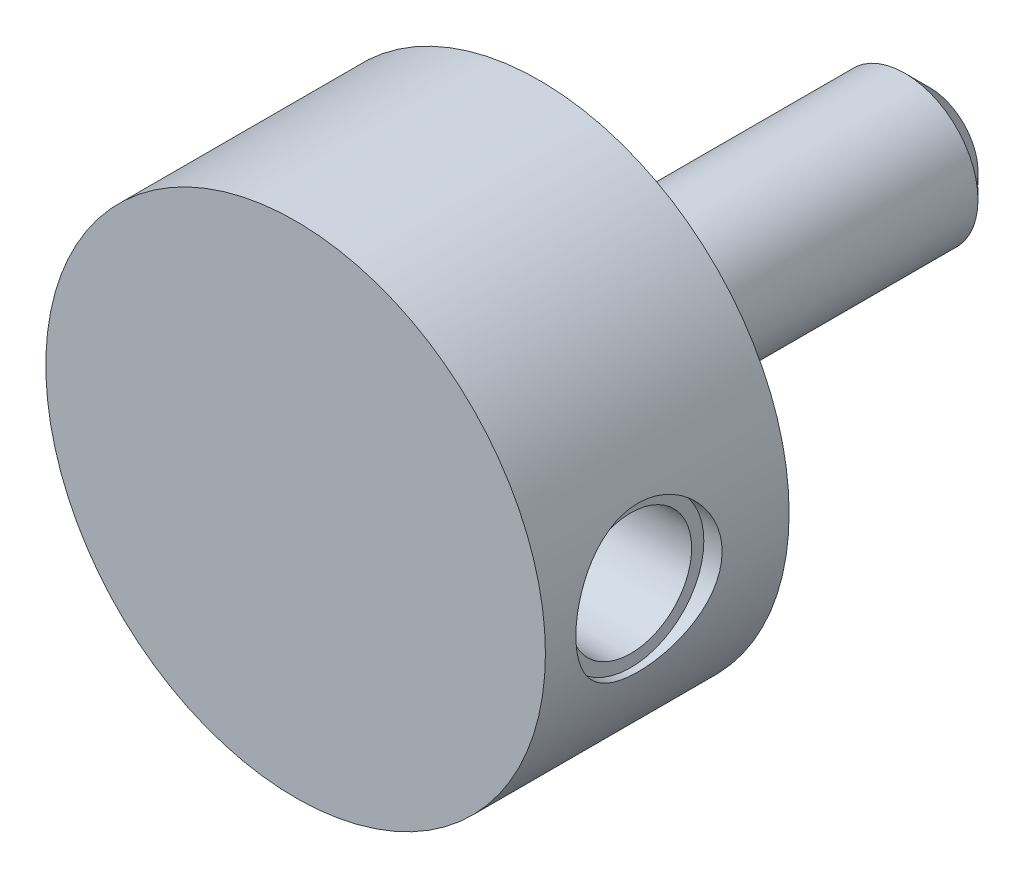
ISO-10303-21;
HEADER;
FILE_DESCRIPTION(('STEP AP214'),'2;1');
FILE_NAME('part.step','',(''),(''),'','','');
FILE_SCHEMA(('AUTOMOTIVE_DESIGN { 1 0 10303 214 1 1 1 1 }'));
ENDSEC;
DATA;
#1=APPLICATION_CONTEXT('core data for automotive mechanical design processes');
#2=APPLICATION_PROTOCOL_DEFINITION('international standard','automotive_design',2000,#1);
#3=PRODUCT_CONTEXT('',#1,'mechanical');
#4=PRODUCT('Part','Part','',(#3));
#5=PRODUCT_RELATED_PRODUCT_CATEGORY('part','',(#4));
#6=PRODUCT_DEFINITION_FORMATION('','',#4);
#7=PRODUCT_DEFINITION_CONTEXT('part definition',#1,'design');
#8=PRODUCT_DEFINITION('design','',#6,#7);
#9=PRODUCT_DEFINITION_SHAPE('','',#8);
#10=(LENGTH_UNIT() NAMED_UNIT(*) SI_UNIT(.MILLI.,.METRE.));
#11=(NAMED_UNIT(*) PLANE_ANGLE_UNIT() SI_UNIT($,.RADIAN.));
#12=(NAMED_UNIT(*) SI_UNIT($,.STERADIAN.) SOLID_ANGLE_UNIT());
#13=UNCERTAINTY_MEASURE_WITH_UNIT(LENGTH_MEASURE(1.E-05),#10,'distance_accuracy_value','');
#14=(GEOMETRIC_REPRESENTATION_CONTEXT(3) GLOBAL_UNCERTAINTY_ASSIGNED_CONTEXT((#13)) GLOBAL_UNIT_ASSIGNED_CONTEXT((#10,
#11,#12)) REPRESENTATION_CONTEXT('',''));
#15=CARTESIAN_POINT('',(0.,0.,0.));
#16=DIRECTION('',(0.,0.,1.));
#17=DIRECTION('',(1.,0.,0.));
#18=AXIS2_PLACEMENT_3D('',#15,#16,#17);
#19=CARTESIAN_POINT('',(0.,0.,0.));
#20=DIRECTION('',(0.,0.,1.));
#21=DIRECTION('',(1.,0.,0.));
#22=AXIS2_PLACEMENT_3D('',#19,#20,#21);
#23=PLANE('',#22);
#24=CARTESIAN_POINT('',(0.,0.,0.));
#25=DIRECTION('',(0.,0.,1.));
#26=DIRECTION('',(1.,0.,0.));
#27=AXIS2_PLACEMENT_3D('',#24,#25,#26);
#28=CIRCLE('',#27,9.5);
#29=CARTESIAN_POINT('',(9.5,0.,0.));
#30=VERTEX_POINT('',#29);
#31=EDGE_CURVE('E27',#30,#30,#28,.T.);
#32=ORIENTED_EDGE('',*,*,#31,.F.);
#33=EDGE_LOOP('',(#32));
#34=FACE_BOUND('',#33,.T.);
#35=CARTESIAN_POINT('',(0.,0.,0.));
#36=DIRECTION('',(0.,0.,1.));
#37=DIRECTION('',(1.,0.,0.));
#38=AXIS2_PLACEMENT_3D('',#35,#36,#37);
#39=CIRCLE('',#38,6.);
#40=CARTESIAN_POINT('',(6.,0.,0.));
#41=VERTEX_POINT('',#40);
#42=EDGE_CURVE('E23',#41,#41,#39,.F.);
#43=ORIENTED_EDGE('',*,*,#42,.F.);
#44=EDGE_LOOP('',(#43));
#45=FACE_BOUND('',#44,.T.);
#46=ADVANCED_FACE('F12',(#34,#45),#23,.F.);
#47=CARTESIAN_POINT('',(0.,0.,40.));
#48=DIRECTION('',(0.,0.,1.));
#49=DIRECTION('',(1.,0.,0.));
#50=AXIS2_PLACEMENT_3D('',#47,#48,#49);
#51=CYLINDRICAL_SURFACE('',#50,9.5);
#52=CARTESIAN_POINT('',(0.,0.,2.));
#53=DIRECTION('',(0.,0.,1.));
#54=DIRECTION('',(1.,0.,0.));
#55=AXIS2_PLACEMENT_3D('',#52,#53,#54);
#56=CIRCLE('',#55,9.5);
#57=CARTESIAN_POINT('',(9.5,0.,2.));
#58=VERTEX_POINT('',#57);
#59=EDGE_CURVE('E38',#58,#58,#56,.T.);
#60=ORIENTED_EDGE('',*,*,#59,.F.);
#61=EDGE_LOOP('',(#60));
#62=FACE_BOUND('',#61,.T.);
#63=ORIENTED_EDGE('',*,*,#31,.T.);
#64=EDGE_LOOP('',(#63));
#65=FACE_BOUND('',#64,.T.);
#66=ADVANCED_FACE('F65',(#62,#65),#51,.T.);
#67=CARTESIAN_POINT('',(20.5,0.,22.));
#68=DIRECTION('',(0.,0.,-1.));
#69=DIRECTION('',(-1.,0.,0.));
#70=AXIS2_PLACEMENT_3D('',#67,#68,#69);
#71=PLANE('',#70);
#72=CARTESIAN_POINT('',(0.,0.,22.));
#73=DIRECTION('',(0.,0.,1.));
#74=DIRECTION('',(1.,0.,0.));
#75=AXIS2_PLACEMENT_3D('',#72,#73,#74);
#76=CIRCLE('',#75,20.5);
#77=CARTESIAN_POINT('',(20.5,0.,22.));
#78=VERTEX_POINT('',#77);
#79=EDGE_CURVE('E82',#78,#78,#76,.T.);
#80=ORIENTED_EDGE('',*,*,#79,.T.);
#81=EDGE_LOOP('',(#80));
#82=FACE_BOUND('',#81,.T.);
#83=ADVANCED_FACE('F60',(#82),#71,.F.);
#84=CARTESIAN_POINT('',(0.,0.,40.));
#85=DIRECTION('',(0.,0.,1.));
#86=DIRECTION('',(1.,0.,0.));
#87=AXIS2_PLACEMENT_3D('',#84,#85,#86);
#88=CYLINDRICAL_SURFACE('',#87,20.5);
#89=CARTESIAN_POINT('',(20.5,0.,7.5));
#90=CARTESIAN_POINT('',(20.4999997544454,-0.164768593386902,7.50000038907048));
#91=CARTESIAN_POINT('',(20.4980087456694,-0.329544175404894,7.50679278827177));
#92=CARTESIAN_POINT('',(20.4900990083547,-0.65788822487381,7.5339021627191));
#93=CARTESIAN_POINT('',(20.4841800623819,-0.821456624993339,7.55421988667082));
#94=CARTESIAN_POINT('',(20.4685766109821,-1.1462122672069,7.60820100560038));
#95=CARTESIAN_POINT('',(20.4588916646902,-1.30739922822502,7.64186596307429));
#96=CARTESIAN_POINT('',(20.4360164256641,-1.62628314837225,7.72226244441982));
#97=CARTESIAN_POINT('',(20.4228249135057,-1.7839788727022,7.76899851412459));
#98=CARTESIAN_POINT('',(20.3933182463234,-2.09448185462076,7.87505403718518));
#99=CARTESIAN_POINT('',(20.3770082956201,-2.24729676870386,7.93435254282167));
#100=CARTESIAN_POINT('',(20.3416823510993,-2.54730770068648,8.06511256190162));
#101=CARTESIAN_POINT('',(20.3226662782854,-2.69450355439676,8.13657443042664));
#102=CARTESIAN_POINT('',(20.2824208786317,-2.98237032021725,8.2911456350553));
#103=CARTESIAN_POINT('',(20.2611910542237,-3.123039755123,8.37425759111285));
#104=CARTESIAN_POINT('',(20.2170775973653,-3.39691169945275,8.55150630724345));
#105=CARTESIAN_POINT('',(20.1941944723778,-3.53011647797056,8.6456396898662));
#106=CARTESIAN_POINT('',(20.146767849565,-3.79154794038,8.84682399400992));
#107=CARTESIAN_POINT('',(20.1221971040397,-3.91956600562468,8.95413966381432));
#108=CARTESIAN_POINT('',(20.0725990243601,-4.1661228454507,9.17897611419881));
#109=CARTESIAN_POINT('',(20.0475718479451,-4.2846648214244,9.29649342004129));
#110=CARTESIAN_POINT('',(19.9977175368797,-4.5116297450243,9.54108035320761));
#111=CARTESIAN_POINT('',(19.9728905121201,-4.62004743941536,9.66815487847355));
#112=CARTESIAN_POINT('',(19.9241410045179,-4.82595045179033,9.93095842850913));
#113=CARTESIAN_POINT('',(19.9002181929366,-4.92343976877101,10.0666842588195));
#114=CARTESIAN_POINT('',(19.8534354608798,-5.10885934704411,10.3490171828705));
#115=CARTESIAN_POINT('',(19.8306098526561,-5.19653638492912,10.4957964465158));
#116=CARTESIAN_POINT('',(19.7872868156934,-5.35913808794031,10.7965125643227));
#117=CARTESIAN_POINT('',(19.766788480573,-5.43406772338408,10.9504465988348));
#118=CARTESIAN_POINT('',(19.7287391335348,-5.57062666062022,11.2645036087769));
#119=CARTESIAN_POINT('',(19.7111887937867,-5.63225293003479,11.4246279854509));
#120=CARTESIAN_POINT('',(19.6796082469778,-5.74162541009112,11.7498143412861));
#121=CARTESIAN_POINT('',(19.6655765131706,-5.78937764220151,11.9148741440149));
#122=CARTESIAN_POINT('',(19.6418018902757,-5.86952471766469,12.2443484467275));
#123=CARTESIAN_POINT('',(19.6319555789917,-5.90229162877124,12.4086649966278));
#124=CARTESIAN_POINT('',(19.6163432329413,-5.95397424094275,12.7395899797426));
#125=CARTESIAN_POINT('',(19.6105755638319,-5.97289549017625,12.9061974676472));
#126=CARTESIAN_POINT('',(19.603301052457,-5.99672775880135,13.2405034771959));
#127=CARTESIAN_POINT('',(19.6017941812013,-6.00163887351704,13.4082019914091));
#128=CARTESIAN_POINT('',(19.6030905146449,-5.99740342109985,13.7434027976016));
#129=CARTESIAN_POINT('',(19.6058936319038,-5.98825713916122,13.9109050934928));
#130=CARTESIAN_POINT('',(19.6155486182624,-5.95655212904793,14.238688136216));
#131=CARTESIAN_POINT('',(19.6222578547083,-5.9344657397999,14.3990190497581));
#132=CARTESIAN_POINT('',(19.6394095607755,-5.87745500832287,14.7172343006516));
#133=CARTESIAN_POINT('',(19.649853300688,-5.84252629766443,14.8751177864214));
#134=CARTESIAN_POINT('',(19.6741615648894,-5.7601395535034,15.187257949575));
#135=CARTESIAN_POINT('',(19.688025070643,-5.71268525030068,15.3415156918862));
#136=CARTESIAN_POINT('',(19.7187796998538,-5.60560692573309,15.6454959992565));
#137=CARTESIAN_POINT('',(19.7356719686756,-5.5459782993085,15.7952168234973));
#138=CARTESIAN_POINT('',(19.7722410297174,-5.41416819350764,16.0910079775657));
#139=CARTESIAN_POINT('',(19.7919506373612,-5.34183608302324,16.2370072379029));
#140=CARTESIAN_POINT('',(19.8334359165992,-5.18568691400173,16.5224423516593));
#141=CARTESIAN_POINT('',(19.8552123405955,-5.10186566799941,16.6618757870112));
#142=CARTESIAN_POINT('',(19.9227548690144,-4.8340177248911,17.0689782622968));
#143=CARTESIAN_POINT('',(19.9707648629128,-4.63350124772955,17.3256854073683));
#144=CARTESIAN_POINT('',(20.0696162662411,-4.18511260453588,17.8126329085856));
#145=CARTESIAN_POINT('',(20.1204944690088,-3.93567819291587,18.0414205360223));
#146=CARTESIAN_POINT('',(20.2176813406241,-3.40132203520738,18.4542852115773));
#147=CARTESIAN_POINT('',(20.2639897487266,-3.11639826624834,18.63835970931));
#148=CARTESIAN_POINT('',(20.3472018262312,-2.51664006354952,18.9573414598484));
#149=CARTESIAN_POINT('',(20.3840462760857,-2.2016334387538,19.0919412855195));
#150=CARTESIAN_POINT('',(20.4437541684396,-1.55212614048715,19.3058343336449));
#151=CARTESIAN_POINT('',(20.4666213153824,-1.21763065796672,19.3851422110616));
#152=CARTESIAN_POINT('',(20.4952175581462,-0.550953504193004,19.4838192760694));
#153=CARTESIAN_POINT('',(20.5015074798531,-0.219085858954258,19.5051506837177));
#154=CARTESIAN_POINT('',(20.4978783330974,0.44350281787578,19.4927506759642));
#155=CARTESIAN_POINT('',(20.4879613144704,0.774223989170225,19.4590262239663));
#156=CARTESIAN_POINT('',(20.4533992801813,1.41781519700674,19.3390673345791));
#157=CARTESIAN_POINT('',(20.4290727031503,1.73091547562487,19.253967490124));
#158=CARTESIAN_POINT('',(20.3684901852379,2.33834273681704,19.0350155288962));
#159=CARTESIAN_POINT('',(20.3322328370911,2.63266749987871,18.901157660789));
#160=CARTESIAN_POINT('',(20.2505580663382,3.201467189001,18.585163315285));
#161=CARTESIAN_POINT('',(20.2049537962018,3.47535043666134,18.4020133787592));
#162=CARTESIAN_POINT('',(20.1098009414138,3.98926947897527,17.9937010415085));
#163=CARTESIAN_POINT('',(20.0602514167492,4.22929716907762,17.7685286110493));
#164=CARTESIAN_POINT('',(19.9860369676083,4.56311282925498,17.3996018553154));
#165=CARTESIAN_POINT('',(19.9608943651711,4.67160496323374,17.2689475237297));
#166=CARTESIAN_POINT('',(19.9116554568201,4.87720494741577,16.9988051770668));
#167=CARTESIAN_POINT('',(19.8875587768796,4.97431688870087,16.8593203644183));
#168=CARTESIAN_POINT('',(19.8411019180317,5.15650338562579,16.5723575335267));
#169=CARTESIAN_POINT('',(19.8187424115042,5.24157329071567,16.4248764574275));
#170=CARTESIAN_POINT('',(19.7764458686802,5.39896546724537,16.1230001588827));
#171=CARTESIAN_POINT('',(19.7565078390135,5.47129297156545,15.9686078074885));
#172=CARTESIAN_POINT('',(19.7197444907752,5.60234699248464,15.6546484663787));
#173=CARTESIAN_POINT('',(19.7029051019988,5.6611353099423,15.49510893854));
#174=CARTESIAN_POINT('',(19.6727610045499,5.76501533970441,15.1713718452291));
#175=CARTESIAN_POINT('',(19.6594548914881,5.81011249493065,15.0071761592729));
#176=CARTESIAN_POINT('',(19.6367999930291,5.88622676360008,14.675294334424));
#177=CARTESIAN_POINT('',(19.6274509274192,5.91724487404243,14.5076084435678));
#178=CARTESIAN_POINT('',(19.6130187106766,5.96490739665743,14.1700260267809));
#179=CARTESIAN_POINT('',(19.6079354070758,5.98155232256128,14.0001295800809));
#180=CARTESIAN_POINT('',(19.6023186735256,5.9999323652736,13.6662567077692));
#181=CARTESIAN_POINT('',(19.6016119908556,6.00223524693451,13.5023141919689));
#182=CARTESIAN_POINT('',(19.6043094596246,5.99341910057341,13.1747666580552));
#183=CARTESIAN_POINT('',(19.6077150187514,5.98229547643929,13.0111617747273));
#184=CARTESIAN_POINT('',(19.6185313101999,5.94672790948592,12.6856110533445));
#185=CARTESIAN_POINT('',(19.6259403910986,5.92228945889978,12.5236645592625));
#186=CARTESIAN_POINT('',(19.6445384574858,5.86030325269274,12.2024601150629));
#187=CARTESIAN_POINT('',(19.6557288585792,5.82275058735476,12.0432031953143));
#188=CARTESIAN_POINT('',(19.6814005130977,5.73537439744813,11.7303823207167));
#189=CARTESIAN_POINT('',(19.6958418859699,5.68569901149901,11.5767736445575));
#190=CARTESIAN_POINT('',(19.7276768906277,5.57423736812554,11.2742707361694));
#191=CARTESIAN_POINT('',(19.7450715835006,5.51244675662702,11.125378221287));
#192=CARTESIAN_POINT('',(19.782319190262,5.37724463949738,10.8333301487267));
#193=CARTESIAN_POINT('',(19.802171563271,5.30383568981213,10.6901733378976));
#194=CARTESIAN_POINT('',(19.8438063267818,5.14587421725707,10.4103722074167));
#195=CARTESIAN_POINT('',(19.8655894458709,5.061317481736,10.2737303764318));
#196=CARTESIAN_POINT('',(19.9112797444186,4.87853600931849,10.0032239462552));
#197=CARTESIAN_POINT('',(19.9352342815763,4.77994030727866,9.86961789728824));
#198=CARTESIAN_POINT('',(19.9839347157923,4.57206196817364,9.61107007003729));
#199=CARTESIAN_POINT('',(20.0086809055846,4.46277534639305,9.48613155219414));
#200=CARTESIAN_POINT('',(20.0582834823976,4.23425660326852,9.24575891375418));
#201=CARTESIAN_POINT('',(20.0831398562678,4.11502564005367,9.13032368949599));
#202=CARTESIAN_POINT('',(20.1323098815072,3.86730499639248,8.90963180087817));
#203=CARTESIAN_POINT('',(20.1566233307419,3.7388119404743,8.80437888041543));
#204=CARTESIAN_POINT('',(20.2046974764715,3.46977987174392,8.6020699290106));
#205=CARTESIAN_POINT('',(20.2284250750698,3.32900807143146,8.50531528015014));
#206=CARTESIAN_POINT('',(20.2739466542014,3.03949915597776,8.32403500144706));
#207=CARTESIAN_POINT('',(20.2957406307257,2.8907620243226,8.23950939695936));
#208=CARTESIAN_POINT('',(20.3367679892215,2.58639447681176,8.0833769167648));
#209=CARTESIAN_POINT('',(20.356002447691,2.43076699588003,8.01176460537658));
#210=CARTESIAN_POINT('',(20.3913677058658,2.11366097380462,7.88201306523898));
#211=CARTESIAN_POINT('',(20.4074988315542,1.95218304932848,7.82387242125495));
#212=CARTESIAN_POINT('',(20.4344672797,1.64423058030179,7.72771145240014));
#213=CARTESIAN_POINT('',(20.4457076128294,1.49828162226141,7.68811373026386));
#214=CARTESIAN_POINT('',(20.4651675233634,1.2036242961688,7.62002138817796));
#215=CARTESIAN_POINT('',(20.4733873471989,1.0549161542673,7.59152586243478));
#216=CARTESIAN_POINT('',(20.4866168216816,0.755624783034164,7.54584620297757));
#217=CARTESIAN_POINT('',(20.491626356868,0.605041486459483,7.52866247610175));
#218=CARTESIAN_POINT('',(20.49831762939,0.302973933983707,7.50574067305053));
#219=CARTESIAN_POINT('',(20.5000002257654,0.151489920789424,7.49999964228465));
#220=CARTESIAN_POINT('',(20.5,0.,7.5));
#221=B_SPLINE_CURVE_WITH_KNOTS('',3,(#89,#90,#91,#92,#93,#94,#95,#96,#97,#98,#99,#100,#101,#102,
#103,#104,#105,#106,#107,#108,#109,#110,#111,#112,#113,#114,#115,#116,#117,#118,#119,#120,#121,
#122,#123,#124,#125,#126,#127,#128,#129,#130,#131,#132,#133,#134,#135,#136,#137,#138,#139,#140,
#141,#142,#143,#144,#145,#146,#147,#148,#149,#150,#151,#152,#153,#154,#155,#156,#157,#158,#159,
#160,#161,#162,#163,#164,#165,#166,#167,#168,#169,#170,#171,#172,#173,#174,#175,#176,#177,#178,
#179,#180,#181,#182,#183,#184,#185,#186,#187,#188,#189,#190,#191,#192,#193,#194,#195,#196,#197,
#198,#199,#200,#201,#202,#203,#204,#205,#206,#207,#208,#209,#210,#211,#212,#213,#214,#215,#216,
#217,#218,#219,#220),.UNSPECIFIED.,.T.,.F.,(4,2,2,2,2,2,2,2,2,2,2,2,2,2,2,2,2,2,2,2,2,2,2,2,2,2,
2,2,2,2,2,2,2,2,2,2,2,2,2,2,2,2,2,2,2,2,2,2,2,2,2,2,2,2,2,2,2,2,2,2,2,2,2,2,2,4),(0.,
0.494166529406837,0.988360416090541,1.48261217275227,1.97703603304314,2.47064184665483,
2.96426207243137,3.45799348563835,3.95157399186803,4.45753270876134,4.96331976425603,
5.46936781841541,5.97523008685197,6.49206535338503,7.00869863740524,7.52544955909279,
8.04197586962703,8.54486934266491,9.04756118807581,9.55024961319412,10.0529278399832,
10.5383093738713,11.0238561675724,11.5092585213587,11.9948448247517,12.4866344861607,
12.9786038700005,13.9617709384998,14.9839152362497,16.006117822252,17.0345689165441,
18.062747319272,19.0556662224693,20.0484595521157,21.0200911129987,21.9918373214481,
22.9853318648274,23.97906383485,24.4935931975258,25.0079370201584,25.5224789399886,
26.0368090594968,26.5487427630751,27.0604726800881,27.5721663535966,28.0838417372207,
28.5751252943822,29.066577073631,29.5578262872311,30.0492596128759,30.5349645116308,
31.0208442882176,31.5066173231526,31.9925744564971,32.4953010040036,32.9982156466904,
33.5010718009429,34.0041121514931,34.5208552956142,35.0375995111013,35.5541256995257,
36.0705976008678,36.525077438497,36.9795201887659,37.4339792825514,37.8883210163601),.UNSPECIFIED.);
#222=CARTESIAN_POINT('',(20.5,0.,7.5));
#223=VERTEX_POINT('',#222);
#224=EDGE_CURVE('E30',#223,#223,#221,.T.);
#225=ORIENTED_EDGE('',*,*,#224,.T.);
#226=EDGE_LOOP('',(#225));
#227=FACE_BOUND('',#226,.T.);
#228=ORIENTED_EDGE('',*,*,#79,.F.);
#229=EDGE_LOOP('',(#228));
#230=FACE_BOUND('',#229,.T.);
#231=CARTESIAN_POINT('',(0.,0.,2.));
#232=DIRECTION('',(0.,0.,1.));
#233=DIRECTION('',(1.,0.,0.));
#234=AXIS2_PLACEMENT_3D('',#231,#232,#233);
#235=CIRCLE('',#234,20.5);
#236=CARTESIAN_POINT('',(20.5,0.,2.));
#237=VERTEX_POINT('',#236);
#238=EDGE_CURVE('E84',#237,#237,#235,.T.);
#239=ORIENTED_EDGE('',*,*,#238,.T.);
#240=EDGE_LOOP('',(#239));
#241=FACE_BOUND('',#240,.T.);
#242=ADVANCED_FACE('F41',(#227,#230,#241),#88,.T.);
#243=CARTESIAN_POINT('',(9.5,0.,2.));
#244=DIRECTION('',(0.,0.,1.));
#245=DIRECTION('',(1.,0.,0.));
#246=AXIS2_PLACEMENT_3D('',#243,#244,#245);
#247=PLANE('',#246);
#248=ORIENTED_EDGE('',*,*,#238,.F.);
#249=EDGE_LOOP('',(#248));
#250=FACE_BOUND('',#249,.T.);
#251=ORIENTED_EDGE('',*,*,#59,.T.);
#252=EDGE_LOOP('',(#251));
#253=FACE_BOUND('',#252,.T.);
#254=ADVANCED_FACE('F49',(#250,#253),#247,.F.);
#255=CARTESIAN_POINT('',(19.,0.,13.5));
#256=DIRECTION('',(1.,0.,0.));
#257=DIRECTION('',(0.,0.,-1.));
#258=AXIS2_PLACEMENT_3D('',#255,#256,#257);
#259=CYLINDRICAL_SURFACE('',#258,6.);
#260=CARTESIAN_POINT('',(19.,0.,13.5));
#261=DIRECTION('',(1.,0.,0.));
#262=DIRECTION('',(0.,0.,-1.));
#263=AXIS2_PLACEMENT_3D('',#260,#261,#262);
#264=CIRCLE('',#263,6.);
#265=CARTESIAN_POINT('',(19.,0.,7.5));
#266=VERTEX_POINT('',#265);
#267=EDGE_CURVE('E39',#266,#266,#264,.T.);
#268=ORIENTED_EDGE('',*,*,#267,.F.);
#269=EDGE_LOOP('',(#268));
#270=FACE_BOUND('',#269,.T.);
#271=ORIENTED_EDGE('',*,*,#224,.F.);
#272=EDGE_LOOP('',(#271));
#273=FACE_BOUND('',#272,.T.);
#274=ADVANCED_FACE('F47',(#270,#273),#259,.F.);
#275=CARTESIAN_POINT('',(19.,0.,13.5));
#276=DIRECTION('',(1.,0.,0.));
#277=DIRECTION('',(0.,0.,-1.));
#278=AXIS2_PLACEMENT_3D('',#275,#276,#277);
#279=PLANE('',#278);
#280=CARTESIAN_POINT('',(19.,0.,13.5));
#281=DIRECTION('',(1.,0.,0.));
#282=DIRECTION('',(0.,0.,-1.));
#283=AXIS2_PLACEMENT_3D('',#280,#281,#282);
#284=CIRCLE('',#283,5.);
#285=CARTESIAN_POINT('',(19.,0.,8.5));
#286=VERTEX_POINT('',#285);
#287=EDGE_CURVE('E96',#286,#286,#284,.T.);
#288=ORIENTED_EDGE('',*,*,#287,.F.);
#289=EDGE_LOOP('',(#288));
#290=FACE_BOUND('',#289,.T.);
#291=ORIENTED_EDGE('',*,*,#267,.T.);
#292=EDGE_LOOP('',(#291));
#293=FACE_BOUND('',#292,.T.);
#294=ADVANCED_FACE('F58',(#290,#293),#279,.T.);
#295=CARTESIAN_POINT('',(10.,0.,13.5));
#296=DIRECTION('',(1.,0.,0.));
#297=DIRECTION('',(0.,0.,-1.));
#298=AXIS2_PLACEMENT_3D('',#295,#296,#297);
#299=CYLINDRICAL_SURFACE('',#298,5.);
#300=CARTESIAN_POINT('',(10.,0.,13.5));
#301=DIRECTION('',(1.,0.,0.));
#302=DIRECTION('',(0.,0.,-1.));
#303=AXIS2_PLACEMENT_3D('',#300,#301,#302);
#304=CIRCLE('',#303,5.);
#305=CARTESIAN_POINT('',(10.,0.,8.5));
#306=VERTEX_POINT('',#305);
#307=EDGE_CURVE('E93',#306,#306,#304,.T.);
#308=ORIENTED_EDGE('',*,*,#307,.F.);
#309=EDGE_LOOP('',(#308));
#310=FACE_BOUND('',#309,.T.);
#311=ORIENTED_EDGE('',*,*,#287,.T.);
#312=EDGE_LOOP('',(#311));
#313=FACE_BOUND('',#312,.T.);
#314=ADVANCED_FACE('F100',(#310,#313),#299,.F.);
#315=CARTESIAN_POINT('',(10.,0.,13.5));
#316=DIRECTION('',(1.,0.,0.));
#317=DIRECTION('',(0.,0.,-1.));
#318=AXIS2_PLACEMENT_3D('',#315,#316,#317);
#319=PLANE('',#318);
#320=ORIENTED_EDGE('',*,*,#307,.T.);
#321=EDGE_LOOP('',(#320));
#322=FACE_BOUND('',#321,.T.);
#323=ADVANCED_FACE('F112',(#322),#319,.T.);
#324=CARTESIAN_POINT('',(0.,0.,-30.));
#325=DIRECTION('',(0.,0.,1.));
#326=DIRECTION('',(1.,0.,0.));
#327=AXIS2_PLACEMENT_3D('',#324,#325,#326);
#328=CYLINDRICAL_SURFACE('',#327,6.);
#329=CARTESIAN_POINT('',(0.,0.,-28.));
#330=DIRECTION('',(0.,0.,-1.));
#331=DIRECTION('',(-1.,0.,0.));
#332=AXIS2_PLACEMENT_3D('',#329,#330,#331);
#333=CIRCLE('',#332,6.);
#334=CARTESIAN_POINT('',(-6.,0.,-28.));
#335=VERTEX_POINT('',#334);
#336=EDGE_CURVE('E8',#335,#335,#333,.F.);
#337=ORIENTED_EDGE('',*,*,#336,.T.);
#338=EDGE_LOOP('',(#337));
#339=FACE_BOUND('',#338,.T.);
#340=ORIENTED_EDGE('',*,*,#42,.T.);
#341=EDGE_LOOP('',(#340));
#342=FACE_BOUND('',#341,.T.);
#343=ADVANCED_FACE('F118',(#339,#342),#328,.T.);
#344=CARTESIAN_POINT('',(0.,0.,-30.));
#345=DIRECTION('',(0.,0.,-1.));
#346=DIRECTION('',(-1.,0.,0.));
#347=AXIS2_PLACEMENT_3D('',#344,#345,#346);
#348=PLANE('',#347);
#349=CARTESIAN_POINT('',(0.,0.,-30.));
#350=DIRECTION('',(0.,0.,-1.));
#351=DIRECTION('',(-1.,0.,0.));
#352=AXIS2_PLACEMENT_3D('',#349,#350,#351);
#353=CIRCLE('',#352,4.);
#354=CARTESIAN_POINT('',(-4.,0.,-30.));
#355=VERTEX_POINT('',#354);
#356=EDGE_CURVE('E19',#355,#355,#353,.T.);
#357=ORIENTED_EDGE('',*,*,#356,.T.);
#358=EDGE_LOOP('',(#357));
#359=FACE_BOUND('',#358,.T.);
#360=ADVANCED_FACE('F122',(#359),#348,.T.);
#361=CARTESIAN_POINT('',(0.,0.,-30.));
#362=DIRECTION('',(0.,0.,1.));
#363=DIRECTION('',(1.,0.,0.));
#364=AXIS2_PLACEMENT_3D('',#361,#362,#363);
#365=CONICAL_SURFACE('',#364,4.,0.785398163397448);
#366=ORIENTED_EDGE('',*,*,#336,.F.);
#367=EDGE_LOOP('',(#366));
#368=FACE_BOUND('',#367,.T.);
#369=ORIENTED_EDGE('',*,*,#356,.F.);
#370=EDGE_LOOP('',(#369));
#371=FACE_BOUND('',#370,.T.);
#372=ADVANCED_FACE('F14',(#368,#371),#365,.T.);
#373=CLOSED_SHELL('',(#46,#66,#83,#242,#254,#274,#294,#314,#323,#343,#360,#372));
#374=MANIFOLD_SOLID_BREP('B1',#373);
#375=ADVANCED_BREP_SHAPE_REPRESENTATION('',(#18,#374),#14);
#376=SHAPE_DEFINITION_REPRESENTATION(#9,#375);
ENDSEC;
END-ISO-10303-21;
